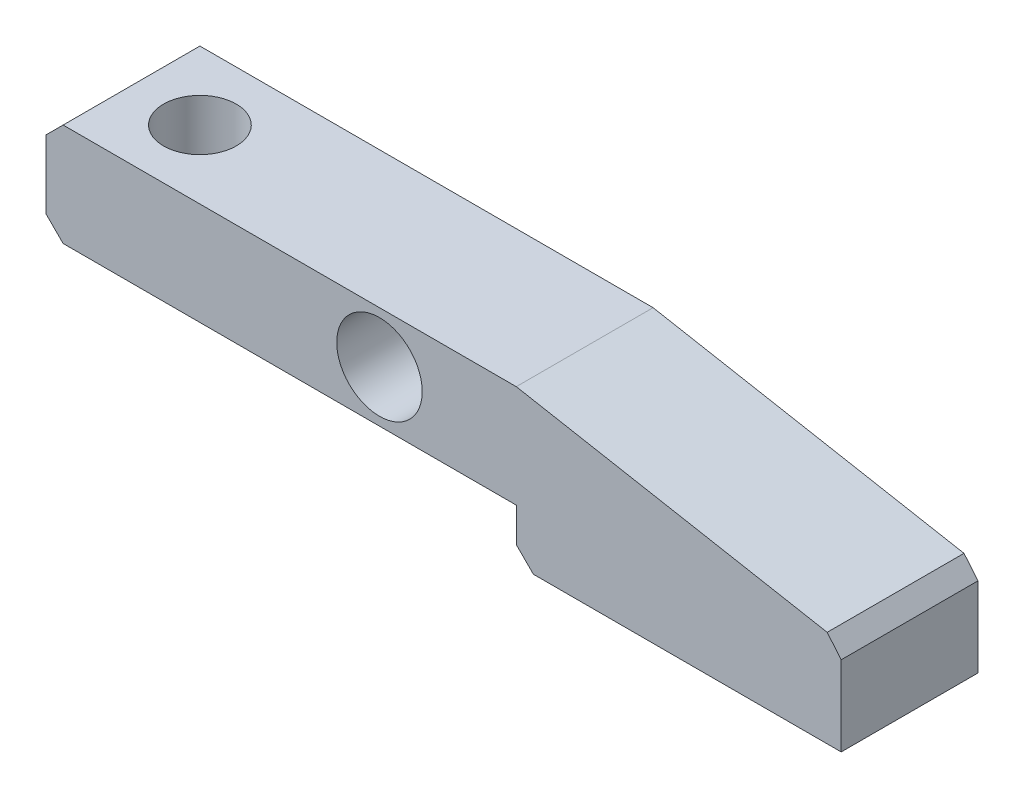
ISO-10303-21;
HEADER;
FILE_DESCRIPTION(('STEP AP214'),'2;1');
FILE_NAME('part.step','',(''),(''),'','','');
FILE_SCHEMA(('AUTOMOTIVE_DESIGN { 1 0 10303 214 1 1 1 1 }'));
ENDSEC;
DATA;
#1=APPLICATION_CONTEXT('core data for automotive mechanical design processes');
#2=APPLICATION_PROTOCOL_DEFINITION('international standard','automotive_design',2000,#1);
#3=PRODUCT_CONTEXT('',#1,'mechanical');
#4=PRODUCT('Part','Part','',(#3));
#5=PRODUCT_RELATED_PRODUCT_CATEGORY('part','',(#4));
#6=PRODUCT_DEFINITION_FORMATION('','',#4);
#7=PRODUCT_DEFINITION_CONTEXT('part definition',#1,'design');
#8=PRODUCT_DEFINITION('design','',#6,#7);
#9=PRODUCT_DEFINITION_SHAPE('','',#8);
#10=(LENGTH_UNIT() NAMED_UNIT(*) SI_UNIT(.MILLI.,.METRE.));
#11=(NAMED_UNIT(*) PLANE_ANGLE_UNIT() SI_UNIT($,.RADIAN.));
#12=(NAMED_UNIT(*) SI_UNIT($,.STERADIAN.) SOLID_ANGLE_UNIT());
#13=UNCERTAINTY_MEASURE_WITH_UNIT(LENGTH_MEASURE(1.E-05),#10,'distance_accuracy_value','');
#14=(GEOMETRIC_REPRESENTATION_CONTEXT(3) GLOBAL_UNCERTAINTY_ASSIGNED_CONTEXT((#13)) GLOBAL_UNIT_ASSIGNED_CONTEXT((#10,
#11,#12)) REPRESENTATION_CONTEXT('',''));
#15=CARTESIAN_POINT('',(0.,0.,0.));
#16=DIRECTION('',(0.,0.,1.));
#17=DIRECTION('',(1.,0.,0.));
#18=AXIS2_PLACEMENT_3D('',#15,#16,#17);
#19=CARTESIAN_POINT('',(-93.,18.,8.));
#20=DIRECTION('',(0.,-1.,0.));
#21=DIRECTION('',(0.,0.,-1.));
#22=AXIS2_PLACEMENT_3D('',#19,#20,#21);
#23=PLANE('',#22);
#24=DIRECTION('',(-1.,0.,0.));
#25=VECTOR('',#24,1.);
#26=CARTESIAN_POINT('',(-93.,18.,-8.));
#27=LINE('',#26,#25);
#28=CARTESIAN_POINT('',(-38.,18.,-8.));
#29=VERTEX_POINT('',#28);
#30=CARTESIAN_POINT('',(-91.,18.,-8.));
#31=VERTEX_POINT('',#30);
#32=EDGE_CURVE('E151',#29,#31,#27,.T.);
#33=ORIENTED_EDGE('',*,*,#32,.T.);
#34=DIRECTION('',(0.,0.,1.));
#35=VECTOR('',#34,1.);
#36=CARTESIAN_POINT('',(-91.,18.,8.));
#37=LINE('',#36,#35);
#38=CARTESIAN_POINT('',(-91.,18.,8.));
#39=VERTEX_POINT('',#38);
#40=EDGE_CURVE('E185',#31,#39,#37,.T.);
#41=ORIENTED_EDGE('',*,*,#40,.T.);
#42=DIRECTION('',(-1.,0.,0.));
#43=VECTOR('',#42,1.);
#44=CARTESIAN_POINT('',(-93.,18.,8.));
#45=LINE('',#44,#43);
#46=CARTESIAN_POINT('',(-38.,18.,8.));
#47=VERTEX_POINT('',#46);
#48=EDGE_CURVE('E166',#47,#39,#45,.T.);
#49=ORIENTED_EDGE('',*,*,#48,.F.);
#50=DIRECTION('',(0.,0.,-1.));
#51=VECTOR('',#50,1.);
#52=CARTESIAN_POINT('',(-38.,18.,8.));
#53=LINE('',#52,#51);
#54=EDGE_CURVE('E169',#47,#29,#53,.T.);
#55=ORIENTED_EDGE('',*,*,#54,.T.);
#56=EDGE_LOOP('',(#33,#41,#49,#55));
#57=FACE_BOUND('',#56,.T.);
#58=CARTESIAN_POINT('',(-83.,18.,0.));
#59=DIRECTION('',(0.,1.,0.));
#60=DIRECTION('',(0.,0.,1.));
#61=AXIS2_PLACEMENT_3D('',#58,#59,#60);
#62=CIRCLE('',#61,4.24999999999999);
#63=CARTESIAN_POINT('',(-83.,18.,4.24999999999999));
#64=VERTEX_POINT('',#63);
#65=EDGE_CURVE('E262',#64,#64,#62,.T.);
#66=ORIENTED_EDGE('',*,*,#65,.F.);
#67=EDGE_LOOP('',(#66));
#68=FACE_BOUND('',#67,.T.);
#69=ADVANCED_FACE('F31',(#57,#68),#23,.F.);
#70=CARTESIAN_POINT('',(-93.,5.99999999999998,8.));
#71=DIRECTION('',(1.,0.,0.));
#72=DIRECTION('',(0.,1.,0.));
#73=AXIS2_PLACEMENT_3D('',#70,#71,#72);
#74=PLANE('',#73);
#75=DIRECTION('',(0.,-1.,0.));
#76=VECTOR('',#75,1.);
#77=CARTESIAN_POINT('',(-93.,5.99999999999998,8.));
#78=LINE('',#77,#76);
#79=CARTESIAN_POINT('',(-93.,15.9999999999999,8.));
#80=VERTEX_POINT('',#79);
#81=CARTESIAN_POINT('',(-93.,7.99999999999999,8.));
#82=VERTEX_POINT('',#81);
#83=EDGE_CURVE('E154',#80,#82,#78,.T.);
#84=ORIENTED_EDGE('',*,*,#83,.F.);
#85=DIRECTION('',(0.,0.,-1.));
#86=VECTOR('',#85,1.);
#87=CARTESIAN_POINT('',(-93.,15.9999999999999,8.));
#88=LINE('',#87,#86);
#89=CARTESIAN_POINT('',(-93.,15.9999999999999,-8.));
#90=VERTEX_POINT('',#89);
#91=EDGE_CURVE('E175',#80,#90,#88,.T.);
#92=ORIENTED_EDGE('',*,*,#91,.T.);
#93=DIRECTION('',(0.,-1.,0.));
#94=VECTOR('',#93,1.);
#95=CARTESIAN_POINT('',(-93.,5.99999999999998,-8.));
#96=LINE('',#95,#94);
#97=CARTESIAN_POINT('',(-93.,8.,-8.));
#98=VERTEX_POINT('',#97);
#99=EDGE_CURVE('E127',#90,#98,#96,.T.);
#100=ORIENTED_EDGE('',*,*,#99,.T.);
#101=DIRECTION('',(0.,0.,1.));
#102=VECTOR('',#101,1.);
#103=CARTESIAN_POINT('',(-93.,8.,8.));
#104=LINE('',#103,#102);
#105=EDGE_CURVE('E135',#98,#82,#104,.T.);
#106=ORIENTED_EDGE('',*,*,#105,.T.);
#107=EDGE_LOOP('',(#84,#92,#100,#106));
#108=FACE_BOUND('',#107,.T.);
#109=ADVANCED_FACE('F33',(#108),#74,.F.);
#110=CARTESIAN_POINT('',(-38.,5.99999999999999,8.));
#111=DIRECTION('',(0.,1.,0.));
#112=DIRECTION('',(-1.,0.,0.));
#113=AXIS2_PLACEMENT_3D('',#110,#111,#112);
#114=PLANE('',#113);
#115=CARTESIAN_POINT('',(-83.,5.99999999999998,0.));
#116=DIRECTION('',(0.,1.,0.));
#117=DIRECTION('',(-1.,0.,0.));
#118=AXIS2_PLACEMENT_3D('',#115,#116,#117);
#119=CIRCLE('',#118,4.25);
#120=CARTESIAN_POINT('',(-87.2500000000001,5.99999999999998,0.));
#121=VERTEX_POINT('',#120);
#122=EDGE_CURVE('E260',#121,#121,#119,.T.);
#123=ORIENTED_EDGE('',*,*,#122,.T.);
#124=EDGE_LOOP('',(#123));
#125=FACE_BOUND('',#124,.T.);
#126=DIRECTION('',(1.,0.,0.));
#127=VECTOR('',#126,1.);
#128=CARTESIAN_POINT('',(-38.,5.99999999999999,8.));
#129=LINE('',#128,#127);
#130=CARTESIAN_POINT('',(-91.,5.99999999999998,8.));
#131=VERTEX_POINT('',#130);
#132=CARTESIAN_POINT('',(-38.,5.99999999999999,8.));
#133=VERTEX_POINT('',#132);
#134=EDGE_CURVE('E157',#131,#133,#129,.T.);
#135=ORIENTED_EDGE('',*,*,#134,.F.);
#136=DIRECTION('',(0.,0.,-1.));
#137=VECTOR('',#136,1.);
#138=CARTESIAN_POINT('',(-91.,5.99999999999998,8.));
#139=LINE('',#138,#137);
#140=CARTESIAN_POINT('',(-91.,5.99999999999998,-8.));
#141=VERTEX_POINT('',#140);
#142=EDGE_CURVE('E123',#131,#141,#139,.T.);
#143=ORIENTED_EDGE('',*,*,#142,.T.);
#144=DIRECTION('',(1.,0.,0.));
#145=VECTOR('',#144,1.);
#146=CARTESIAN_POINT('',(-38.,5.99999999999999,-8.));
#147=LINE('',#146,#145);
#148=CARTESIAN_POINT('',(-38.,5.99999999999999,-8.));
#149=VERTEX_POINT('',#148);
#150=EDGE_CURVE('E116',#141,#149,#147,.T.);
#151=ORIENTED_EDGE('',*,*,#150,.T.);
#152=DIRECTION('',(0.,0.,-1.));
#153=VECTOR('',#152,1.);
#154=CARTESIAN_POINT('',(-38.,5.99999999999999,8.));
#155=LINE('',#154,#153);
#156=EDGE_CURVE('E120',#133,#149,#155,.T.);
#157=ORIENTED_EDGE('',*,*,#156,.F.);
#158=EDGE_LOOP('',(#135,#143,#151,#157));
#159=FACE_BOUND('',#158,.T.);
#160=ADVANCED_FACE('F119',(#125,#159),#114,.F.);
#161=CARTESIAN_POINT('',(-38.,0.,8.));
#162=DIRECTION('',(1.,0.,0.));
#163=DIRECTION('',(0.,1.,0.));
#164=AXIS2_PLACEMENT_3D('',#161,#162,#163);
#165=PLANE('',#164);
#166=DIRECTION('',(0.,-1.,0.));
#167=VECTOR('',#166,1.);
#168=CARTESIAN_POINT('',(-38.,0.,-8.));
#169=LINE('',#168,#167);
#170=CARTESIAN_POINT('',(-38.,2.,-8.));
#171=VERTEX_POINT('',#170);
#172=EDGE_CURVE('E126',#149,#171,#169,.T.);
#173=ORIENTED_EDGE('',*,*,#172,.T.);
#174=DIRECTION('',(0.,0.,1.));
#175=VECTOR('',#174,1.);
#176=CARTESIAN_POINT('',(-38.,2.,8.));
#177=LINE('',#176,#175);
#178=CARTESIAN_POINT('',(-38.,2.,8.));
#179=VERTEX_POINT('',#178);
#180=EDGE_CURVE('E11',#171,#179,#177,.T.);
#181=ORIENTED_EDGE('',*,*,#180,.T.);
#182=DIRECTION('',(0.,-1.,0.));
#183=VECTOR('',#182,1.);
#184=CARTESIAN_POINT('',(-38.,0.,8.));
#185=LINE('',#184,#183);
#186=EDGE_CURVE('E134',#133,#179,#185,.T.);
#187=ORIENTED_EDGE('',*,*,#186,.F.);
#188=ORIENTED_EDGE('',*,*,#156,.T.);
#189=EDGE_LOOP('',(#173,#181,#187,#188));
#190=FACE_BOUND('',#189,.T.);
#191=ADVANCED_FACE('F131',(#190),#165,.F.);
#192=CARTESIAN_POINT('',(0.,0.,8.));
#193=DIRECTION('',(0.,1.,0.));
#194=DIRECTION('',(-1.,0.,0.));
#195=AXIS2_PLACEMENT_3D('',#192,#193,#194);
#196=PLANE('',#195);
#197=DIRECTION('',(1.,0.,0.));
#198=VECTOR('',#197,1.);
#199=CARTESIAN_POINT('',(0.,0.,8.));
#200=LINE('',#199,#198);
#201=CARTESIAN_POINT('',(-35.9999999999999,0.,8.));
#202=VERTEX_POINT('',#201);
#203=CARTESIAN_POINT('',(0.,0.,8.));
#204=VERTEX_POINT('',#203);
#205=EDGE_CURVE('E160',#202,#204,#200,.T.);
#206=ORIENTED_EDGE('',*,*,#205,.F.);
#207=DIRECTION('',(0.,0.,-1.));
#208=VECTOR('',#207,1.);
#209=CARTESIAN_POINT('',(-36.,0.,8.));
#210=LINE('',#209,#208);
#211=CARTESIAN_POINT('',(-36.,0.,-8.));
#212=VERTEX_POINT('',#211);
#213=EDGE_CURVE('E39',#202,#212,#210,.T.);
#214=ORIENTED_EDGE('',*,*,#213,.T.);
#215=DIRECTION('',(1.,0.,0.));
#216=VECTOR('',#215,1.);
#217=CARTESIAN_POINT('',(0.,0.,-8.));
#218=LINE('',#217,#216);
#219=CARTESIAN_POINT('',(0.,0.,-8.));
#220=VERTEX_POINT('',#219);
#221=EDGE_CURVE('E142',#212,#220,#218,.T.);
#222=ORIENTED_EDGE('',*,*,#221,.T.);
#223=DIRECTION('',(0.,0.,-1.));
#224=VECTOR('',#223,1.);
#225=CARTESIAN_POINT('',(0.,0.,8.));
#226=LINE('',#225,#224);
#227=EDGE_CURVE('E136',#204,#220,#226,.T.);
#228=ORIENTED_EDGE('',*,*,#227,.F.);
#229=EDGE_LOOP('',(#206,#214,#222,#228));
#230=FACE_BOUND('',#229,.T.);
#231=ADVANCED_FACE('F202',(#230),#196,.F.);
#232=CARTESIAN_POINT('',(0.,11.,8.));
#233=DIRECTION('',(-1.,0.,0.));
#234=DIRECTION('',(0.,-1.,0.));
#235=AXIS2_PLACEMENT_3D('',#232,#233,#234);
#236=PLANE('',#235);
#237=DIRECTION('',(0.,1.,0.));
#238=VECTOR('',#237,1.);
#239=CARTESIAN_POINT('',(0.,11.,-8.));
#240=LINE('',#239,#238);
#241=CARTESIAN_POINT('',(0.,9.33477062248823,-8.));
#242=VERTEX_POINT('',#241);
#243=EDGE_CURVE('E144',#220,#242,#240,.T.);
#244=ORIENTED_EDGE('',*,*,#243,.T.);
#245=DIRECTION('',(0.,0.,1.));
#246=VECTOR('',#245,1.);
#247=CARTESIAN_POINT('',(0.,9.33477062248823,8.));
#248=LINE('',#247,#246);
#249=CARTESIAN_POINT('',(0.,9.33477062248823,8.));
#250=VERTEX_POINT('',#249);
#251=EDGE_CURVE('E54',#242,#250,#248,.T.);
#252=ORIENTED_EDGE('',*,*,#251,.T.);
#253=DIRECTION('',(0.,1.,0.));
#254=VECTOR('',#253,1.);
#255=CARTESIAN_POINT('',(0.,11.,8.));
#256=LINE('',#255,#254);
#257=EDGE_CURVE('E162',#204,#250,#256,.T.);
#258=ORIENTED_EDGE('',*,*,#257,.F.);
#259=ORIENTED_EDGE('',*,*,#227,.T.);
#260=EDGE_LOOP('',(#244,#252,#258,#259));
#261=FACE_BOUND('',#260,.T.);
#262=ADVANCED_FACE('F208',(#261),#236,.F.);
#263=CARTESIAN_POINT('',(-38.,18.,8.));
#264=DIRECTION('',(-0.181162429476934,-0.983453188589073,0.));
#265=DIRECTION('',(0.983453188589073,-0.181162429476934,0.));
#266=AXIS2_PLACEMENT_3D('',#263,#264,#265);
#267=PLANE('',#266);
#268=DIRECTION('',(-0.983453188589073,0.181162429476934,0.));
#269=VECTOR('',#268,1.);
#270=CARTESIAN_POINT('',(-38.,18.,8.));
#271=LINE('',#270,#269);
#272=CARTESIAN_POINT('',(-1.63767514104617,11.3016769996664,8.));
#273=VERTEX_POINT('',#272);
#274=EDGE_CURVE('E164',#273,#47,#271,.T.);
#275=ORIENTED_EDGE('',*,*,#274,.F.);
#276=DIRECTION('',(0.,0.,-1.));
#277=VECTOR('',#276,1.);
#278=CARTESIAN_POINT('',(-1.63767514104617,11.3016769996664,8.));
#279=LINE('',#278,#277);
#280=CARTESIAN_POINT('',(-1.63767514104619,11.3016769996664,-8.));
#281=VERTEX_POINT('',#280);
#282=EDGE_CURVE('E194',#273,#281,#279,.T.);
#283=ORIENTED_EDGE('',*,*,#282,.T.);
#284=DIRECTION('',(-0.983453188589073,0.181162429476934,0.));
#285=VECTOR('',#284,1.);
#286=CARTESIAN_POINT('',(-38.,18.,-8.));
#287=LINE('',#286,#285);
#288=EDGE_CURVE('E149',#281,#29,#287,.T.);
#289=ORIENTED_EDGE('',*,*,#288,.T.);
#290=ORIENTED_EDGE('',*,*,#54,.F.);
#291=EDGE_LOOP('',(#275,#283,#289,#290));
#292=FACE_BOUND('',#291,.T.);
#293=ADVANCED_FACE('F213',(#292),#267,.F.);
#294=CARTESIAN_POINT('',(-93.,0.,8.));
#295=DIRECTION('',(0.,0.,1.));
#296=DIRECTION('',(1.,0.,0.));
#297=AXIS2_PLACEMENT_3D('',#294,#295,#296);
#298=PLANE('',#297);
#299=CARTESIAN_POINT('',(-54.,12.,8.));
#300=DIRECTION('',(0.,0.,1.));
#301=DIRECTION('',(1.,0.,0.));
#302=AXIS2_PLACEMENT_3D('',#299,#300,#301);
#303=CIRCLE('',#302,5.);
#304=CARTESIAN_POINT('',(-49.,12.,8.));
#305=VERTEX_POINT('',#304);
#306=EDGE_CURVE('E270',#305,#305,#303,.T.);
#307=ORIENTED_EDGE('',*,*,#306,.F.);
#308=EDGE_LOOP('',(#307));
#309=FACE_BOUND('',#308,.T.);
#310=ORIENTED_EDGE('',*,*,#48,.T.);
#311=DIRECTION('',(0.707106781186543,0.707106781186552,0.));
#312=VECTOR('',#311,1.);
#313=CARTESIAN_POINT('',(-101.,7.99999999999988,8.));
#314=LINE('',#313,#312);
#315=EDGE_CURVE('E192',#39,#80,#314,.F.);
#316=ORIENTED_EDGE('',*,*,#315,.T.);
#317=ORIENTED_EDGE('',*,*,#83,.T.);
#318=DIRECTION('',(-0.707106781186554,0.707106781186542,0.));
#319=VECTOR('',#318,1.);
#320=CARTESIAN_POINT('',(-89.,4.00000000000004,8.));
#321=LINE('',#320,#319);
#322=EDGE_CURVE('E189',#82,#131,#321,.F.);
#323=ORIENTED_EDGE('',*,*,#322,.T.);
#324=ORIENTED_EDGE('',*,*,#134,.T.);
#325=ORIENTED_EDGE('',*,*,#186,.T.);
#326=DIRECTION('',(-0.707106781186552,0.707106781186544,0.));
#327=VECTOR('',#326,1.);
#328=CARTESIAN_POINT('',(-64.5000000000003,28.5,8.));
#329=LINE('',#328,#327);
#330=EDGE_CURVE('E187',#179,#202,#329,.F.);
#331=ORIENTED_EDGE('',*,*,#330,.T.);
#332=ORIENTED_EDGE('',*,*,#205,.T.);
#333=ORIENTED_EDGE('',*,*,#257,.T.);
#334=DIRECTION('',(0.639858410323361,-0.768492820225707,0.));
#335=VECTOR('',#334,1.);
#336=CARTESIAN_POINT('',(-33.4857920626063,49.5524037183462,8.));
#337=LINE('',#336,#335);
#338=EDGE_CURVE('E46',#250,#273,#337,.F.);
#339=ORIENTED_EDGE('',*,*,#338,.T.);
#340=ORIENTED_EDGE('',*,*,#274,.T.);
#341=EDGE_LOOP('',(#310,#316,#317,#323,#324,#325,#331,#332,#333,#339,#340));
#342=FACE_BOUND('',#341,.T.);
#343=ADVANCED_FACE('F225',(#309,#342),#298,.T.);
#344=CARTESIAN_POINT('',(-93.,0.,-8.));
#345=DIRECTION('',(0.,0.,1.));
#346=DIRECTION('',(1.,0.,0.));
#347=AXIS2_PLACEMENT_3D('',#344,#345,#346);
#348=PLANE('',#347);
#349=CARTESIAN_POINT('',(-54.,12.,-8.));
#350=DIRECTION('',(0.,0.,1.));
#351=DIRECTION('',(1.,0.,0.));
#352=AXIS2_PLACEMENT_3D('',#349,#350,#351);
#353=CIRCLE('',#352,5.);
#354=CARTESIAN_POINT('',(-49.,12.,-8.));
#355=VERTEX_POINT('',#354);
#356=EDGE_CURVE('E265',#355,#355,#353,.T.);
#357=ORIENTED_EDGE('',*,*,#356,.T.);
#358=EDGE_LOOP('',(#357));
#359=FACE_BOUND('',#358,.T.);
#360=ORIENTED_EDGE('',*,*,#99,.F.);
#361=DIRECTION('',(-0.707106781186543,-0.707106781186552,0.));
#362=VECTOR('',#361,1.);
#363=CARTESIAN_POINT('',(-93.,15.9999999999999,-8.));
#364=LINE('',#363,#362);
#365=EDGE_CURVE('E183',#90,#31,#364,.F.);
#366=ORIENTED_EDGE('',*,*,#365,.T.);
#367=ORIENTED_EDGE('',*,*,#32,.F.);
#368=ORIENTED_EDGE('',*,*,#288,.F.);
#369=DIRECTION('',(-0.639858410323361,0.768492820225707,0.));
#370=VECTOR('',#369,1.);
#371=CARTESIAN_POINT('',(-1.63767514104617,11.3016769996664,-8.));
#372=LINE('',#371,#370);
#373=EDGE_CURVE('E181',#281,#242,#372,.F.);
#374=ORIENTED_EDGE('',*,*,#373,.T.);
#375=ORIENTED_EDGE('',*,*,#243,.F.);
#376=ORIENTED_EDGE('',*,*,#221,.F.);
#377=DIRECTION('',(0.707106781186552,-0.707106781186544,0.));
#378=VECTOR('',#377,1.);
#379=CARTESIAN_POINT('',(-36.,0.,-8.));
#380=LINE('',#379,#378);
#381=EDGE_CURVE('E141',#212,#171,#380,.F.);
#382=ORIENTED_EDGE('',*,*,#381,.T.);
#383=ORIENTED_EDGE('',*,*,#172,.F.);
#384=ORIENTED_EDGE('',*,*,#150,.F.);
#385=DIRECTION('',(0.707106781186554,-0.707106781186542,0.));
#386=VECTOR('',#385,1.);
#387=CARTESIAN_POINT('',(-91.,5.99999999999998,-8.));
#388=LINE('',#387,#386);
#389=EDGE_CURVE('E179',#141,#98,#388,.F.);
#390=ORIENTED_EDGE('',*,*,#389,.T.);
#391=EDGE_LOOP('',(#360,#366,#367,#368,#374,#375,#376,#382,#383,#384,#390));
#392=FACE_BOUND('',#391,.T.);
#393=ADVANCED_FACE('F139',(#359,#392),#348,.F.);
#394=CARTESIAN_POINT('',(-83.,18.,0.));
#395=DIRECTION('',(0.,1.,0.));
#396=DIRECTION('',(0.,0.,1.));
#397=AXIS2_PLACEMENT_3D('',#394,#395,#396);
#398=CYLINDRICAL_SURFACE('',#397,4.25);
#399=ORIENTED_EDGE('',*,*,#122,.F.);
#400=EDGE_LOOP('',(#399));
#401=FACE_BOUND('',#400,.T.);
#402=ORIENTED_EDGE('',*,*,#65,.T.);
#403=EDGE_LOOP('',(#402));
#404=FACE_BOUND('',#403,.T.);
#405=ADVANCED_FACE('F280',(#401,#404),#398,.F.);
#406=CARTESIAN_POINT('',(-54.,12.,8.));
#407=DIRECTION('',(0.,0.,1.));
#408=DIRECTION('',(1.,0.,0.));
#409=AXIS2_PLACEMENT_3D('',#406,#407,#408);
#410=CYLINDRICAL_SURFACE('',#409,5.);
#411=ORIENTED_EDGE('',*,*,#356,.F.);
#412=EDGE_LOOP('',(#411));
#413=FACE_BOUND('',#412,.T.);
#414=ORIENTED_EDGE('',*,*,#306,.T.);
#415=EDGE_LOOP('',(#414));
#416=FACE_BOUND('',#415,.T.);
#417=ADVANCED_FACE('F274',(#413,#416),#410,.F.);
#418=CARTESIAN_POINT('',(-93.,15.9999999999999,8.));
#419=DIRECTION('',(0.707106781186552,-0.707106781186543,0.));
#420=DIRECTION('',(0.707106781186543,0.707106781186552,0.));
#421=AXIS2_PLACEMENT_3D('',#418,#419,#420);
#422=PLANE('',#421);
#423=ORIENTED_EDGE('',*,*,#315,.F.);
#424=ORIENTED_EDGE('',*,*,#40,.F.);
#425=ORIENTED_EDGE('',*,*,#365,.F.);
#426=ORIENTED_EDGE('',*,*,#91,.F.);
#427=EDGE_LOOP('',(#423,#424,#425,#426));
#428=FACE_BOUND('',#427,.T.);
#429=ADVANCED_FACE('F222',(#428),#422,.F.);
#430=CARTESIAN_POINT('',(-1.63767514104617,11.3016769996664,8.));
#431=DIRECTION('',(-0.768492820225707,-0.639858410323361,0.));
#432=DIRECTION('',(0.639858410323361,-0.768492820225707,0.));
#433=AXIS2_PLACEMENT_3D('',#430,#431,#432);
#434=PLANE('',#433);
#435=ORIENTED_EDGE('',*,*,#338,.F.);
#436=ORIENTED_EDGE('',*,*,#251,.F.);
#437=ORIENTED_EDGE('',*,*,#373,.F.);
#438=ORIENTED_EDGE('',*,*,#282,.F.);
#439=EDGE_LOOP('',(#435,#436,#437,#438));
#440=FACE_BOUND('',#439,.T.);
#441=ADVANCED_FACE('F210',(#440),#434,.F.);
#442=CARTESIAN_POINT('',(-91.,5.99999999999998,8.));
#443=DIRECTION('',(0.707106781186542,0.707106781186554,0.));
#444=DIRECTION('',(-0.707106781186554,0.707106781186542,0.));
#445=AXIS2_PLACEMENT_3D('',#442,#443,#444);
#446=PLANE('',#445);
#447=ORIENTED_EDGE('',*,*,#322,.F.);
#448=ORIENTED_EDGE('',*,*,#105,.F.);
#449=ORIENTED_EDGE('',*,*,#389,.F.);
#450=ORIENTED_EDGE('',*,*,#142,.F.);
#451=EDGE_LOOP('',(#447,#448,#449,#450));
#452=FACE_BOUND('',#451,.T.);
#453=ADVANCED_FACE('F231',(#452),#446,.F.);
#454=CARTESIAN_POINT('',(-36.,0.,8.));
#455=DIRECTION('',(0.707106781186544,0.707106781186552,0.));
#456=DIRECTION('',(-0.707106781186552,0.707106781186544,0.));
#457=AXIS2_PLACEMENT_3D('',#454,#455,#456);
#458=PLANE('',#457);
#459=ORIENTED_EDGE('',*,*,#330,.F.);
#460=ORIENTED_EDGE('',*,*,#180,.F.);
#461=ORIENTED_EDGE('',*,*,#381,.F.);
#462=ORIENTED_EDGE('',*,*,#213,.F.);
#463=EDGE_LOOP('',(#459,#460,#461,#462));
#464=FACE_BOUND('',#463,.T.);
#465=ADVANCED_FACE('F232',(#464),#458,.F.);
#466=CLOSED_SHELL('',(#69,#109,#160,#191,#231,#262,#293,#343,#393,#405,#417,#429,#441,#453,#465));
#467=MANIFOLD_SOLID_BREP('B2',#466);
#468=ADVANCED_BREP_SHAPE_REPRESENTATION('',(#18,#467),#14);
#469=SHAPE_DEFINITION_REPRESENTATION(#9,#468);
ENDSEC;
END-ISO-10303-21;
